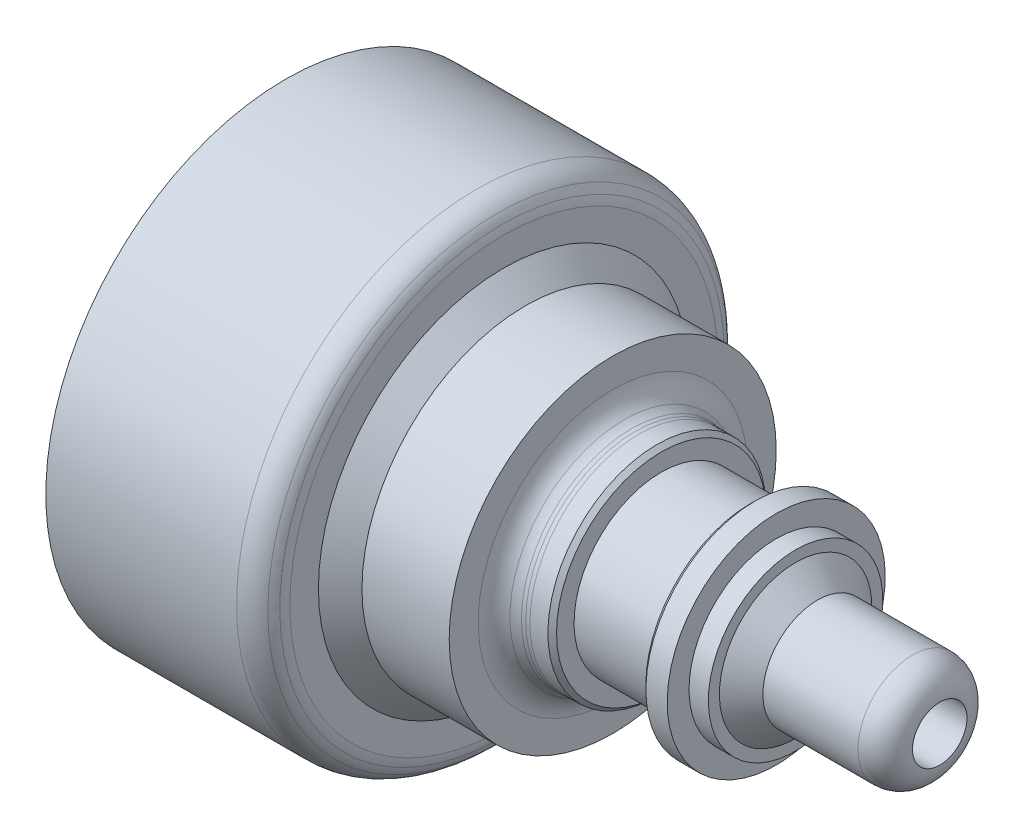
ISO-10303-21;
HEADER;
FILE_DESCRIPTION(('STEP AP214'),'2;1');
FILE_NAME('part.step','',(''),(''),'','','');
FILE_SCHEMA(('AUTOMOTIVE_DESIGN { 1 0 10303 214 1 1 1 1 }'));
ENDSEC;
DATA;
#1=APPLICATION_CONTEXT('core data for automotive mechanical design processes');
#2=APPLICATION_PROTOCOL_DEFINITION('international standard','automotive_design',2000,#1);
#3=PRODUCT_CONTEXT('',#1,'mechanical');
#4=PRODUCT('Part','Part','',(#3));
#5=PRODUCT_RELATED_PRODUCT_CATEGORY('part','',(#4));
#6=PRODUCT_DEFINITION_FORMATION('','',#4);
#7=PRODUCT_DEFINITION_CONTEXT('part definition',#1,'design');
#8=PRODUCT_DEFINITION('design','',#6,#7);
#9=PRODUCT_DEFINITION_SHAPE('','',#8);
#10=(LENGTH_UNIT() NAMED_UNIT(*) SI_UNIT(.MILLI.,.METRE.));
#11=(NAMED_UNIT(*) PLANE_ANGLE_UNIT() SI_UNIT($,.RADIAN.));
#12=(NAMED_UNIT(*) SI_UNIT($,.STERADIAN.) SOLID_ANGLE_UNIT());
#13=UNCERTAINTY_MEASURE_WITH_UNIT(LENGTH_MEASURE(1.E-05),#10,'distance_accuracy_value','');
#14=(GEOMETRIC_REPRESENTATION_CONTEXT(3) GLOBAL_UNCERTAINTY_ASSIGNED_CONTEXT((#13)) GLOBAL_UNIT_ASSIGNED_CONTEXT((#10,
#11,#12)) REPRESENTATION_CONTEXT('',''));
#15=CARTESIAN_POINT('',(0.,0.,0.));
#16=DIRECTION('',(0.,0.,1.));
#17=DIRECTION('',(1.,0.,0.));
#18=AXIS2_PLACEMENT_3D('',#15,#16,#17);
#19=CARTESIAN_POINT('',(-76.1999999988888,0.,0.));
#20=DIRECTION('',(1.,0.,0.));
#21=DIRECTION('',(0.,1.,0.));
#22=AXIS2_PLACEMENT_3D('',#19,#20,#21);
#23=CYLINDRICAL_SURFACE('',#22,27.9399999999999);
#24=CARTESIAN_POINT('',(-76.1999999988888,0.,0.));
#25=DIRECTION('',(1.,0.,0.));
#26=DIRECTION('',(0.,1.,0.));
#27=AXIS2_PLACEMENT_3D('',#24,#25,#26);
#28=CIRCLE('',#27,27.94);
#29=CARTESIAN_POINT('',(-76.1999999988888,27.94,0.));
#30=VERTEX_POINT('',#29);
#31=EDGE_CURVE('E11',#30,#30,#28,.T.);
#32=ORIENTED_EDGE('',*,*,#31,.T.);
#33=EDGE_LOOP('',(#32));
#34=FACE_BOUND('',#33,.T.);
#35=CARTESIAN_POINT('',(-53.975,0.,0.));
#36=DIRECTION('',(1.,0.,0.));
#37=DIRECTION('',(0.,1.,0.));
#38=AXIS2_PLACEMENT_3D('',#35,#36,#37);
#39=CIRCLE('',#38,27.9399999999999);
#40=CARTESIAN_POINT('',(-53.975,27.9399999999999,0.));
#41=VERTEX_POINT('',#40);
#42=EDGE_CURVE('E125',#41,#41,#39,.T.);
#43=ORIENTED_EDGE('',*,*,#42,.F.);
#44=EDGE_LOOP('',(#43));
#45=FACE_BOUND('',#44,.T.);
#46=ADVANCED_FACE('F46',(#34,#45),#23,.T.);
#47=CARTESIAN_POINT('',(-76.1999999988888,27.94,0.));
#48=DIRECTION('',(-1.,0.,0.));
#49=DIRECTION('',(0.,-1.,0.));
#50=AXIS2_PLACEMENT_3D('',#47,#48,#49);
#51=PLANE('',#50);
#52=ORIENTED_EDGE('',*,*,#31,.F.);
#53=EDGE_LOOP('',(#52));
#54=FACE_BOUND('',#53,.T.);
#55=ADVANCED_FACE('F145',(#54),#51,.T.);
#56=CARTESIAN_POINT('',(-3.18841080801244,0.,0.));
#57=DIRECTION('',(1.,0.,0.));
#58=DIRECTION('',(0.,1.,0.));
#59=AXIS2_PLACEMENT_3D('',#56,#57,#58);
#60=DEGENERATE_TOROIDAL_SURFACE('',#59,3.16167397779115,3.1884145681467,.T.);
#61=CARTESIAN_POINT('',(-2.40881332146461E-05,0.,0.));
#62=DIRECTION('',(-1.,0.,0.));
#63=DIRECTION('',(0.,-1.,0.));
#64=AXIS2_PLACEMENT_3D('',#61,#62,#63);
#65=CIRCLE('',#64,3.175);
#66=CARTESIAN_POINT('',(-2.40881332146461E-05,-3.175,0.));
#67=VERTEX_POINT('',#66);
#68=EDGE_CURVE('E49',#67,#67,#65,.F.);
#69=ORIENTED_EDGE('',*,*,#68,.F.);
#70=EDGE_LOOP('',(#69));
#71=FACE_BOUND('',#70,.T.);
#72=CARTESIAN_POINT('',(-3.17499999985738,0.,0.));
#73=DIRECTION('',(1.,0.,0.));
#74=DIRECTION('',(0.,1.,0.));
#75=AXIS2_PLACEMENT_3D('',#72,#73,#74);
#76=CIRCLE('',#75,6.35006034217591);
#77=CARTESIAN_POINT('',(-3.17499999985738,6.35006034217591,0.));
#78=VERTEX_POINT('',#77);
#79=EDGE_CURVE('E53',#78,#78,#76,.T.);
#80=ORIENTED_EDGE('',*,*,#79,.T.);
#81=EDGE_LOOP('',(#80));
#82=FACE_BOUND('',#81,.T.);
#83=ADVANCED_FACE('F141',(#71,#82),#60,.T.);
#84=CARTESIAN_POINT('',(-76.1999999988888,0.,0.));
#85=DIRECTION('',(1.,0.,0.));
#86=DIRECTION('',(0.,1.,0.));
#87=AXIS2_PLACEMENT_3D('',#84,#85,#86);
#88=CYLINDRICAL_SURFACE('',#87,6.35006034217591);
#89=CARTESIAN_POINT('',(-14.2544799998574,0.,0.));
#90=DIRECTION('',(1.,0.,0.));
#91=DIRECTION('',(0.,1.,0.));
#92=AXIS2_PLACEMENT_3D('',#89,#90,#91);
#93=CIRCLE('',#92,6.35006034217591);
#94=CARTESIAN_POINT('',(-14.2544799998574,6.35006034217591,0.));
#95=VERTEX_POINT('',#94);
#96=EDGE_CURVE('E57',#95,#95,#93,.T.);
#97=ORIENTED_EDGE('',*,*,#96,.T.);
#98=EDGE_LOOP('',(#97));
#99=FACE_BOUND('',#98,.T.);
#100=ORIENTED_EDGE('',*,*,#79,.F.);
#101=EDGE_LOOP('',(#100));
#102=FACE_BOUND('',#101,.T.);
#103=ADVANCED_FACE('F144',(#99,#102),#88,.T.);
#104=CARTESIAN_POINT('',(-14.2544799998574,0.,0.));
#105=DIRECTION('',(-1.,0.,0.));
#106=DIRECTION('',(0.,-1.,0.));
#107=AXIS2_PLACEMENT_3D('',#104,#105,#106);
#108=CONICAL_SURFACE('',#107,6.35006034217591,0.78289504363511);
#109=CARTESIAN_POINT('',(-16.7944799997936,0.,0.));
#110=DIRECTION('',(1.,0.,0.));
#111=DIRECTION('',(0.,1.,0.));
#112=AXIS2_PLACEMENT_3D('',#109,#110,#111);
#113=CIRCLE('',#112,8.87737621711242);
#114=CARTESIAN_POINT('',(-16.7944799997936,8.87737621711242,0.));
#115=VERTEX_POINT('',#114);
#116=EDGE_CURVE('E62',#115,#115,#113,.T.);
#117=ORIENTED_EDGE('',*,*,#116,.T.);
#118=EDGE_LOOP('',(#117));
#119=FACE_BOUND('',#118,.T.);
#120=ORIENTED_EDGE('',*,*,#96,.F.);
#121=EDGE_LOOP('',(#120));
#122=FACE_BOUND('',#121,.T.);
#123=ADVANCED_FACE('F150',(#119,#122),#108,.T.);
#124=CARTESIAN_POINT('',(-16.7944799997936,8.87737621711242,0.));
#125=DIRECTION('',(1.,0.,0.));
#126=DIRECTION('',(0.,1.,0.));
#127=AXIS2_PLACEMENT_3D('',#124,#125,#126);
#128=PLANE('',#127);
#129=CARTESIAN_POINT('',(-16.7944799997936,0.,0.));
#130=DIRECTION('',(1.,0.,0.));
#131=DIRECTION('',(0.,1.,0.));
#132=AXIS2_PLACEMENT_3D('',#129,#130,#131);
#133=CIRCLE('',#132,10.160032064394);
#134=CARTESIAN_POINT('',(-16.7944799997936,10.160032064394,0.));
#135=VERTEX_POINT('',#134);
#136=EDGE_CURVE('E65',#135,#135,#133,.T.);
#137=ORIENTED_EDGE('',*,*,#136,.T.);
#138=EDGE_LOOP('',(#137));
#139=FACE_BOUND('',#138,.T.);
#140=ORIENTED_EDGE('',*,*,#116,.F.);
#141=EDGE_LOOP('',(#140));
#142=FACE_BOUND('',#141,.T.);
#143=ADVANCED_FACE('F157',(#139,#142),#128,.T.);
#144=CARTESIAN_POINT('',(-76.1999999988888,0.,0.));
#145=DIRECTION('',(1.,0.,0.));
#146=DIRECTION('',(0.,1.,0.));
#147=AXIS2_PLACEMENT_3D('',#144,#145,#146);
#148=CYLINDRICAL_SURFACE('',#147,10.160032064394);
#149=CARTESIAN_POINT('',(-19.049999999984,0.,0.));
#150=DIRECTION('',(1.,0.,0.));
#151=DIRECTION('',(0.,1.,0.));
#152=AXIS2_PLACEMENT_3D('',#149,#150,#151);
#153=CIRCLE('',#152,10.160032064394);
#154=CARTESIAN_POINT('',(-19.049999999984,10.160032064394,0.));
#155=VERTEX_POINT('',#154);
#156=EDGE_CURVE('E68',#155,#155,#153,.T.);
#157=ORIENTED_EDGE('',*,*,#156,.T.);
#158=EDGE_LOOP('',(#157));
#159=FACE_BOUND('',#158,.T.);
#160=ORIENTED_EDGE('',*,*,#136,.F.);
#161=EDGE_LOOP('',(#160));
#162=FACE_BOUND('',#161,.T.);
#163=ADVANCED_FACE('F278',(#159,#162),#148,.T.);
#164=CARTESIAN_POINT('',(-19.049999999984,10.160032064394,0.));
#165=DIRECTION('',(1.,0.,0.));
#166=DIRECTION('',(0.,1.,0.));
#167=AXIS2_PLACEMENT_3D('',#164,#165,#166);
#168=PLANE('',#167);
#169=CARTESIAN_POINT('',(-19.049999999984,0.,0.));
#170=DIRECTION('',(1.,0.,0.));
#171=DIRECTION('',(0.,1.,0.));
#172=AXIS2_PLACEMENT_3D('',#169,#170,#171);
#173=CIRCLE('',#172,12.7000000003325);
#174=CARTESIAN_POINT('',(-19.049999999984,12.7000000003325,0.));
#175=VERTEX_POINT('',#174);
#176=EDGE_CURVE('E71',#175,#175,#173,.T.);
#177=ORIENTED_EDGE('',*,*,#176,.T.);
#178=EDGE_LOOP('',(#177));
#179=FACE_BOUND('',#178,.T.);
#180=ORIENTED_EDGE('',*,*,#156,.F.);
#181=EDGE_LOOP('',(#180));
#182=FACE_BOUND('',#181,.T.);
#183=ADVANCED_FACE('F272',(#179,#182),#168,.T.);
#184=CARTESIAN_POINT('',(-76.1999999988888,0.,0.));
#185=DIRECTION('',(1.,0.,0.));
#186=DIRECTION('',(0.,1.,0.));
#187=AXIS2_PLACEMENT_3D('',#184,#185,#186);
#188=CYLINDRICAL_SURFACE('',#187,12.7000000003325);
#189=CARTESIAN_POINT('',(-21.531580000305,0.,0.));
#190=DIRECTION('',(1.,0.,0.));
#191=DIRECTION('',(0.,1.,0.));
#192=AXIS2_PLACEMENT_3D('',#189,#190,#191);
#193=CIRCLE('',#192,12.7000000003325);
#194=CARTESIAN_POINT('',(-21.531580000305,12.7000000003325,0.));
#195=VERTEX_POINT('',#194);
#196=EDGE_CURVE('E74',#195,#195,#193,.T.);
#197=ORIENTED_EDGE('',*,*,#196,.T.);
#198=EDGE_LOOP('',(#197));
#199=FACE_BOUND('',#198,.T.);
#200=ORIENTED_EDGE('',*,*,#176,.F.);
#201=EDGE_LOOP('',(#200));
#202=FACE_BOUND('',#201,.T.);
#203=ADVANCED_FACE('F266',(#199,#202),#188,.T.);
#204=CARTESIAN_POINT('',(-21.531580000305,0.,0.));
#205=DIRECTION('',(1.,0.,0.));
#206=DIRECTION('',(0.,1.,0.));
#207=AXIS2_PLACEMENT_3D('',#204,#205,#206);
#208=CONICAL_SURFACE('',#207,12.7000000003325,0.772820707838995);
#209=CARTESIAN_POINT('',(-22.039580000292,0.,0.));
#210=DIRECTION('',(1.,0.,0.));
#211=DIRECTION('',(0.,1.,0.));
#212=AXIS2_PLACEMENT_3D('',#209,#210,#211);
#213=CIRCLE('',#212,12.2046206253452);
#214=CARTESIAN_POINT('',(-22.039580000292,12.2046206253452,0.));
#215=VERTEX_POINT('',#214);
#216=EDGE_CURVE('E77',#215,#215,#213,.T.);
#217=ORIENTED_EDGE('',*,*,#216,.T.);
#218=EDGE_LOOP('',(#217));
#219=FACE_BOUND('',#218,.T.);
#220=ORIENTED_EDGE('',*,*,#196,.F.);
#221=EDGE_LOOP('',(#220));
#222=FACE_BOUND('',#221,.T.);
#223=ADVANCED_FACE('F260',(#219,#222),#208,.T.);
#224=CARTESIAN_POINT('',(-22.039580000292,12.2046206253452,0.));
#225=DIRECTION('',(-1.,0.,0.));
#226=DIRECTION('',(0.,-1.,0.));
#227=AXIS2_PLACEMENT_3D('',#224,#225,#226);
#228=PLANE('',#227);
#229=CARTESIAN_POINT('',(-22.039580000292,0.,0.));
#230=DIRECTION('',(1.,0.,0.));
#231=DIRECTION('',(0.,1.,0.));
#232=AXIS2_PLACEMENT_3D('',#229,#230,#231);
#233=CIRCLE('',#232,10.1600000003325);
#234=CARTESIAN_POINT('',(-22.039580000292,10.1600000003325,0.));
#235=VERTEX_POINT('',#234);
#236=EDGE_CURVE('E80',#235,#235,#233,.T.);
#237=ORIENTED_EDGE('',*,*,#236,.T.);
#238=EDGE_LOOP('',(#237));
#239=FACE_BOUND('',#238,.T.);
#240=ORIENTED_EDGE('',*,*,#216,.F.);
#241=EDGE_LOOP('',(#240));
#242=FACE_BOUND('',#241,.T.);
#243=ADVANCED_FACE('F254',(#239,#242),#228,.T.);
#244=CARTESIAN_POINT('',(-76.1999999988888,0.,0.));
#245=DIRECTION('',(1.,0.,0.));
#246=DIRECTION('',(0.,1.,0.));
#247=AXIS2_PLACEMENT_3D('',#244,#245,#246);
#248=CYLINDRICAL_SURFACE('',#247,10.1600000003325);
#249=CARTESIAN_POINT('',(-32.4434199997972,0.,0.));
#250=DIRECTION('',(1.,0.,0.));
#251=DIRECTION('',(0.,1.,0.));
#252=AXIS2_PLACEMENT_3D('',#249,#250,#251);
#253=CIRCLE('',#252,10.1600000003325);
#254=CARTESIAN_POINT('',(-32.4434199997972,10.1600000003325,0.));
#255=VERTEX_POINT('',#254);
#256=EDGE_CURVE('E83',#255,#255,#253,.T.);
#257=ORIENTED_EDGE('',*,*,#256,.T.);
#258=EDGE_LOOP('',(#257));
#259=FACE_BOUND('',#258,.T.);
#260=ORIENTED_EDGE('',*,*,#236,.F.);
#261=EDGE_LOOP('',(#260));
#262=FACE_BOUND('',#261,.T.);
#263=ADVANCED_FACE('F248',(#259,#262),#248,.T.);
#264=CARTESIAN_POINT('',(-32.4434199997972,10.1600000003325,0.));
#265=DIRECTION('',(1.,0.,0.));
#266=DIRECTION('',(0.,1.,0.));
#267=AXIS2_PLACEMENT_3D('',#264,#265,#266);
#268=PLANE('',#267);
#269=CARTESIAN_POINT('',(-32.4434199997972,0.,0.));
#270=DIRECTION('',(1.,0.,0.));
#271=DIRECTION('',(0.,1.,0.));
#272=AXIS2_PLACEMENT_3D('',#269,#270,#271);
#273=CIRCLE('',#272,12.2043110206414);
#274=CARTESIAN_POINT('',(-32.4434199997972,12.2043110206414,0.));
#275=VERTEX_POINT('',#274);
#276=EDGE_CURVE('E86',#275,#275,#273,.T.);
#277=ORIENTED_EDGE('',*,*,#276,.T.);
#278=EDGE_LOOP('',(#277));
#279=FACE_BOUND('',#278,.T.);
#280=ORIENTED_EDGE('',*,*,#256,.F.);
#281=EDGE_LOOP('',(#280));
#282=FACE_BOUND('',#281,.T.);
#283=ADVANCED_FACE('F242',(#279,#282),#268,.T.);
#284=CARTESIAN_POINT('',(-32.4434199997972,0.,0.));
#285=DIRECTION('',(-1.,0.,0.));
#286=DIRECTION('',(0.,-1.,0.));
#287=AXIS2_PLACEMENT_3D('',#284,#285,#286);
#288=CONICAL_SURFACE('',#287,12.2043110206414,0.773133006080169);
#289=CARTESIAN_POINT('',(-32.9514200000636,0.,0.));
#290=DIRECTION('',(1.,0.,0.));
#291=DIRECTION('',(0.,1.,0.));
#292=AXIS2_PLACEMENT_3D('',#289,#290,#291);
#293=CIRCLE('',#292,12.7000000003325);
#294=CARTESIAN_POINT('',(-32.9514200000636,12.7000000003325,0.));
#295=VERTEX_POINT('',#294);
#296=EDGE_CURVE('E89',#295,#295,#293,.T.);
#297=ORIENTED_EDGE('',*,*,#296,.T.);
#298=EDGE_LOOP('',(#297));
#299=FACE_BOUND('',#298,.T.);
#300=ORIENTED_EDGE('',*,*,#276,.F.);
#301=EDGE_LOOP('',(#300));
#302=FACE_BOUND('',#301,.T.);
#303=ADVANCED_FACE('F236',(#299,#302),#288,.T.);
#304=CARTESIAN_POINT('',(-32.9514200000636,0.,0.));
#305=DIRECTION('',(-1.,0.,0.));
#306=DIRECTION('',(0.,-1.,0.));
#307=AXIS2_PLACEMENT_3D('',#304,#305,#306);
#308=CONICAL_SURFACE('',#307,12.7000000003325,0.00304421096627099);
#309=CARTESIAN_POINT('',(-35.039182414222,0.,0.));
#310=DIRECTION('',(1.,0.,0.));
#311=DIRECTION('',(0.,1.,0.));
#312=AXIS2_PLACEMENT_3D('',#309,#310,#311);
#313=CIRCLE('',#312,12.7063556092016);
#314=CARTESIAN_POINT('',(-35.039182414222,12.7063556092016,0.));
#315=VERTEX_POINT('',#314);
#316=EDGE_CURVE('E92',#315,#315,#313,.T.);
#317=ORIENTED_EDGE('',*,*,#316,.T.);
#318=EDGE_LOOP('',(#317));
#319=FACE_BOUND('',#318,.T.);
#320=ORIENTED_EDGE('',*,*,#296,.F.);
#321=EDGE_LOOP('',(#320));
#322=FACE_BOUND('',#321,.T.);
#323=ADVANCED_FACE('F230',(#319,#322),#308,.T.);
#324=CARTESIAN_POINT('',(-34.9702905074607,0.,0.));
#325=DIRECTION('',(1.,0.,0.));
#326=DIRECTION('',(0.,1.,0.));
#327=AXIS2_PLACEMENT_3D('',#324,#325,#326);
#328=TOROIDAL_SURFACE('',#327,14.879760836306,2.17449680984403);
#329=CARTESIAN_POINT('',(-35.4764078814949,0.,0.));
#330=DIRECTION('',(1.,0.,0.));
#331=DIRECTION('',(0.,1.,0.));
#332=AXIS2_PLACEMENT_3D('',#329,#330,#331);
#333=CIRCLE('',#332,12.7649838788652);
#334=CARTESIAN_POINT('',(-35.4764078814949,12.7649838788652,0.));
#335=VERTEX_POINT('',#334);
#336=EDGE_CURVE('E95',#335,#335,#333,.T.);
#337=ORIENTED_EDGE('',*,*,#336,.T.);
#338=EDGE_LOOP('',(#337));
#339=FACE_BOUND('',#338,.T.);
#340=ORIENTED_EDGE('',*,*,#316,.F.);
#341=EDGE_LOOP('',(#340));
#342=FACE_BOUND('',#341,.T.);
#343=ADVANCED_FACE('F224',(#339,#342),#328,.F.);
#344=CARTESIAN_POINT('',(-35.31333986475,0.,0.));
#345=DIRECTION('',(1.,0.,0.));
#346=DIRECTION('',(0.,1.,0.));
#347=AXIS2_PLACEMENT_3D('',#344,#345,#346);
#348=TOROIDAL_SURFACE('',#347,14.5000629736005,1.74272506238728);
#349=CARTESIAN_POINT('',(-35.8812037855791,0.,0.));
#350=DIRECTION('',(1.,0.,0.));
#351=DIRECTION('',(0.,1.,0.));
#352=AXIS2_PLACEMENT_3D('',#349,#350,#351);
#353=CIRCLE('',#352,12.8524522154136);
#354=CARTESIAN_POINT('',(-35.8812037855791,12.8524522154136,0.));
#355=VERTEX_POINT('',#354);
#356=EDGE_CURVE('E98',#355,#355,#353,.T.);
#357=ORIENTED_EDGE('',*,*,#356,.T.);
#358=EDGE_LOOP('',(#357));
#359=FACE_BOUND('',#358,.T.);
#360=ORIENTED_EDGE('',*,*,#336,.F.);
#361=EDGE_LOOP('',(#360));
#362=FACE_BOUND('',#361,.T.);
#363=ADVANCED_FACE('F218',(#359,#362),#348,.F.);
#364=CARTESIAN_POINT('',(-34.9786619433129,0.,0.));
#365=DIRECTION('',(1.,0.,0.));
#366=DIRECTION('',(0.,1.,0.));
#367=AXIS2_PLACEMENT_3D('',#364,#365,#366);
#368=TOROIDAL_SURFACE('',#367,15.7594861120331,3.04391653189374);
#369=CARTESIAN_POINT('',(-36.7731478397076,0.,0.));
#370=DIRECTION('',(1.,0.,0.));
#371=DIRECTION('',(0.,1.,0.));
#372=AXIS2_PLACEMENT_3D('',#369,#370,#371);
#373=CIRCLE('',#372,13.3007774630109);
#374=CARTESIAN_POINT('',(-36.7731478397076,13.3007774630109,0.));
#375=VERTEX_POINT('',#374);
#376=EDGE_CURVE('E101',#375,#375,#373,.T.);
#377=ORIENTED_EDGE('',*,*,#376,.T.);
#378=EDGE_LOOP('',(#377));
#379=FACE_BOUND('',#378,.T.);
#380=ORIENTED_EDGE('',*,*,#356,.F.);
#381=EDGE_LOOP('',(#380));
#382=FACE_BOUND('',#381,.T.);
#383=ADVANCED_FACE('F212',(#379,#382),#368,.F.);
#384=CARTESIAN_POINT('',(-34.8759581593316,0.,0.));
#385=DIRECTION('',(1.,0.,0.));
#386=DIRECTION('',(0.,1.,0.));
#387=AXIS2_PLACEMENT_3D('',#384,#385,#386);
#388=TOROIDAL_SURFACE('',#387,15.9192612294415,3.23354077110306);
#389=CARTESIAN_POINT('',(-38.1000000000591,0.,0.));
#390=DIRECTION('',(1.,0.,0.));
#391=DIRECTION('',(0.,1.,0.));
#392=AXIS2_PLACEMENT_3D('',#389,#390,#391);
#393=CIRCLE('',#392,15.6715918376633);
#394=CARTESIAN_POINT('',(-38.1000000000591,15.6715918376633,0.));
#395=VERTEX_POINT('',#394);
#396=EDGE_CURVE('E104',#395,#395,#393,.T.);
#397=ORIENTED_EDGE('',*,*,#396,.T.);
#398=EDGE_LOOP('',(#397));
#399=FACE_BOUND('',#398,.T.);
#400=ORIENTED_EDGE('',*,*,#376,.F.);
#401=EDGE_LOOP('',(#400));
#402=FACE_BOUND('',#401,.T.);
#403=ADVANCED_FACE('F206',(#399,#402),#388,.F.);
#404=CARTESIAN_POINT('',(-38.1000000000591,15.6715918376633,0.));
#405=DIRECTION('',(1.,0.,0.));
#406=DIRECTION('',(0.,1.,0.));
#407=AXIS2_PLACEMENT_3D('',#404,#405,#406);
#408=PLANE('',#407);
#409=CARTESIAN_POINT('',(-38.1000000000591,0.,0.));
#410=DIRECTION('',(1.,0.,0.));
#411=DIRECTION('',(0.,1.,0.));
#412=AXIS2_PLACEMENT_3D('',#409,#410,#411);
#413=CIRCLE('',#412,19.0500000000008);
#414=CARTESIAN_POINT('',(-38.1000000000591,19.0500000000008,0.));
#415=VERTEX_POINT('',#414);
#416=EDGE_CURVE('E107',#415,#415,#413,.T.);
#417=ORIENTED_EDGE('',*,*,#416,.T.);
#418=EDGE_LOOP('',(#417));
#419=FACE_BOUND('',#418,.T.);
#420=ORIENTED_EDGE('',*,*,#396,.F.);
#421=EDGE_LOOP('',(#420));
#422=FACE_BOUND('',#421,.T.);
#423=ADVANCED_FACE('F200',(#419,#422),#408,.T.);
#424=CARTESIAN_POINT('',(-76.1999999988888,0.,0.));
#425=DIRECTION('',(1.,0.,0.));
#426=DIRECTION('',(0.,1.,0.));
#427=AXIS2_PLACEMENT_3D('',#424,#425,#426);
#428=CYLINDRICAL_SURFACE('',#427,19.0500000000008);
#429=CARTESIAN_POINT('',(-48.2600000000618,0.,0.));
#430=DIRECTION('',(1.,0.,0.));
#431=DIRECTION('',(0.,1.,0.));
#432=AXIS2_PLACEMENT_3D('',#429,#430,#431);
#433=CIRCLE('',#432,19.0500000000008);
#434=CARTESIAN_POINT('',(-48.2600000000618,19.0500000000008,0.));
#435=VERTEX_POINT('',#434);
#436=EDGE_CURVE('E110',#435,#435,#433,.T.);
#437=ORIENTED_EDGE('',*,*,#436,.T.);
#438=EDGE_LOOP('',(#437));
#439=FACE_BOUND('',#438,.T.);
#440=ORIENTED_EDGE('',*,*,#416,.F.);
#441=EDGE_LOOP('',(#440));
#442=FACE_BOUND('',#441,.T.);
#443=ADVANCED_FACE('F194',(#439,#442),#428,.T.);
#444=CARTESIAN_POINT('',(-48.2600000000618,0.,0.));
#445=DIRECTION('',(-1.,0.,0.));
#446=DIRECTION('',(0.,-1.,0.));
#447=AXIS2_PLACEMENT_3D('',#444,#445,#446);
#448=CONICAL_SURFACE('',#447,19.0500000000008,0.783924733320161);
#449=CARTESIAN_POINT('',(-50.7999999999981,0.,0.));
#450=DIRECTION('',(1.,0.,0.));
#451=DIRECTION('',(0.,1.,0.));
#452=AXIS2_PLACEMENT_3D('',#449,#450,#451);
#453=CIRCLE('',#452,21.5825259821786);
#454=CARTESIAN_POINT('',(-50.7999999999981,21.5825259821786,0.));
#455=VERTEX_POINT('',#454);
#456=EDGE_CURVE('E113',#455,#455,#453,.T.);
#457=ORIENTED_EDGE('',*,*,#456,.T.);
#458=EDGE_LOOP('',(#457));
#459=FACE_BOUND('',#458,.T.);
#460=ORIENTED_EDGE('',*,*,#436,.F.);
#461=EDGE_LOOP('',(#460));
#462=FACE_BOUND('',#461,.T.);
#463=ADVANCED_FACE('F188',(#459,#462),#448,.T.);
#464=CARTESIAN_POINT('',(-50.7999999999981,21.5825259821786,0.));
#465=DIRECTION('',(1.,0.,0.));
#466=DIRECTION('',(0.,1.,0.));
#467=AXIS2_PLACEMENT_3D('',#464,#465,#466);
#468=PLANE('',#467);
#469=CARTESIAN_POINT('',(-50.7999999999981,0.,0.));
#470=DIRECTION('',(1.,0.,0.));
#471=DIRECTION('',(0.,1.,0.));
#472=AXIS2_PLACEMENT_3D('',#469,#470,#471);
#473=CIRCLE('',#472,24.9133731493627);
#474=CARTESIAN_POINT('',(-50.7999999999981,24.9133731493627,0.));
#475=VERTEX_POINT('',#474);
#476=EDGE_CURVE('E116',#475,#475,#473,.T.);
#477=ORIENTED_EDGE('',*,*,#476,.T.);
#478=EDGE_LOOP('',(#477));
#479=FACE_BOUND('',#478,.T.);
#480=ORIENTED_EDGE('',*,*,#456,.F.);
#481=EDGE_LOOP('',(#480));
#482=FACE_BOUND('',#481,.T.);
#483=ADVANCED_FACE('F182',(#479,#482),#468,.T.);
#484=CARTESIAN_POINT('',(-54.6448804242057,0.,0.));
#485=DIRECTION('',(1.,0.,0.));
#486=DIRECTION('',(0.,1.,0.));
#487=AXIS2_PLACEMENT_3D('',#484,#485,#486);
#488=TOROIDAL_SURFACE('',#487,24.5922903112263,3.85826381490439);
#489=CARTESIAN_POINT('',(-51.0057421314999,0.,0.));
#490=DIRECTION('',(1.,0.,0.));
#491=DIRECTION('',(0.,1.,0.));
#492=AXIS2_PLACEMENT_3D('',#489,#490,#491);
#493=CIRCLE('',#492,25.8740360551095);
#494=CARTESIAN_POINT('',(-51.0057421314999,25.8740360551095,0.));
#495=VERTEX_POINT('',#494);
#496=EDGE_CURVE('E119',#495,#495,#493,.T.);
#497=ORIENTED_EDGE('',*,*,#496,.T.);
#498=EDGE_LOOP('',(#497));
#499=FACE_BOUND('',#498,.T.);
#500=ORIENTED_EDGE('',*,*,#476,.F.);
#501=EDGE_LOOP('',(#500));
#502=FACE_BOUND('',#501,.T.);
#503=ADVANCED_FACE('F176',(#499,#502),#488,.T.);
#504=CARTESIAN_POINT('',(-53.9279075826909,0.,0.));
#505=DIRECTION('',(1.,0.,0.));
#506=DIRECTION('',(0.,1.,0.));
#507=AXIS2_PLACEMENT_3D('',#504,#505,#506);
#508=TOROIDAL_SURFACE('',#507,24.7920091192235,3.11606052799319);
#509=CARTESIAN_POINT('',(-51.5114037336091,0.,0.));
#510=DIRECTION('',(1.,0.,0.));
#511=DIRECTION('',(0.,1.,0.));
#512=AXIS2_PLACEMENT_3D('',#509,#510,#511);
#513=CIRCLE('',#512,26.7593276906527);
#514=CARTESIAN_POINT('',(-51.5114037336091,26.7593276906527,0.));
#515=VERTEX_POINT('',#514);
#516=EDGE_CURVE('E122',#515,#515,#513,.T.);
#517=ORIENTED_EDGE('',*,*,#516,.T.);
#518=EDGE_LOOP('',(#517));
#519=FACE_BOUND('',#518,.T.);
#520=ORIENTED_EDGE('',*,*,#496,.F.);
#521=EDGE_LOOP('',(#520));
#522=FACE_BOUND('',#521,.T.);
#523=ADVANCED_FACE('F170',(#519,#522),#508,.T.);
#524=CARTESIAN_POINT('',(-53.9986164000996,0.,0.));
#525=DIRECTION('',(1.,0.,0.));
#526=DIRECTION('',(0.,1.,0.));
#527=AXIS2_PLACEMENT_3D('',#524,#525,#526);
#528=TOROIDAL_SURFACE('',#527,24.7301101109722,3.20997676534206);
#529=ORIENTED_EDGE('',*,*,#42,.T.);
#530=EDGE_LOOP('',(#529));
#531=FACE_BOUND('',#530,.T.);
#532=ORIENTED_EDGE('',*,*,#516,.F.);
#533=EDGE_LOOP('',(#532));
#534=FACE_BOUND('',#533,.T.);
#535=ADVANCED_FACE('F167',(#531,#534),#528,.T.);
#536=CARTESIAN_POINT('',(-12.7,0.,0.));
#537=DIRECTION('',(1.,0.,0.));
#538=DIRECTION('',(0.,1.,0.));
#539=AXIS2_PLACEMENT_3D('',#536,#537,#538);
#540=CYLINDRICAL_SURFACE('',#539,3.175);
#541=ORIENTED_EDGE('',*,*,#68,.T.);
#542=EDGE_LOOP('',(#541));
#543=FACE_BOUND('',#542,.T.);
#544=CARTESIAN_POINT('',(-12.7,0.,0.));
#545=DIRECTION('',(1.,0.,0.));
#546=DIRECTION('',(0.,1.,0.));
#547=AXIS2_PLACEMENT_3D('',#544,#545,#546);
#548=CIRCLE('',#547,3.175);
#549=CARTESIAN_POINT('',(-12.7,3.175,0.));
#550=VERTEX_POINT('',#549);
#551=EDGE_CURVE('E127',#550,#550,#548,.T.);
#552=ORIENTED_EDGE('',*,*,#551,.F.);
#553=EDGE_LOOP('',(#552));
#554=FACE_BOUND('',#553,.T.);
#555=ADVANCED_FACE('F138',(#543,#554),#540,.F.);
#556=CARTESIAN_POINT('',(-12.7,0.,0.));
#557=DIRECTION('',(1.,0.,0.));
#558=DIRECTION('',(0.,1.,0.));
#559=AXIS2_PLACEMENT_3D('',#556,#557,#558);
#560=PLANE('',#559);
#561=ORIENTED_EDGE('',*,*,#551,.T.);
#562=EDGE_LOOP('',(#561));
#563=FACE_BOUND('',#562,.T.);
#564=ADVANCED_FACE('F298',(#563),#560,.T.);
#565=CLOSED_SHELL('',(#46,#55,#83,#103,#123,#143,#163,#183,#203,#223,#243,#263,#283,#303,#323,
#343,#363,#383,#403,#423,#443,#463,#483,#503,#523,#535,#555,#564));
#566=MANIFOLD_SOLID_BREP('B2',#565);
#567=ADVANCED_BREP_SHAPE_REPRESENTATION('',(#18,#566),#14);
#568=SHAPE_DEFINITION_REPRESENTATION(#9,#567);
ENDSEC;
END-ISO-10303-21;
